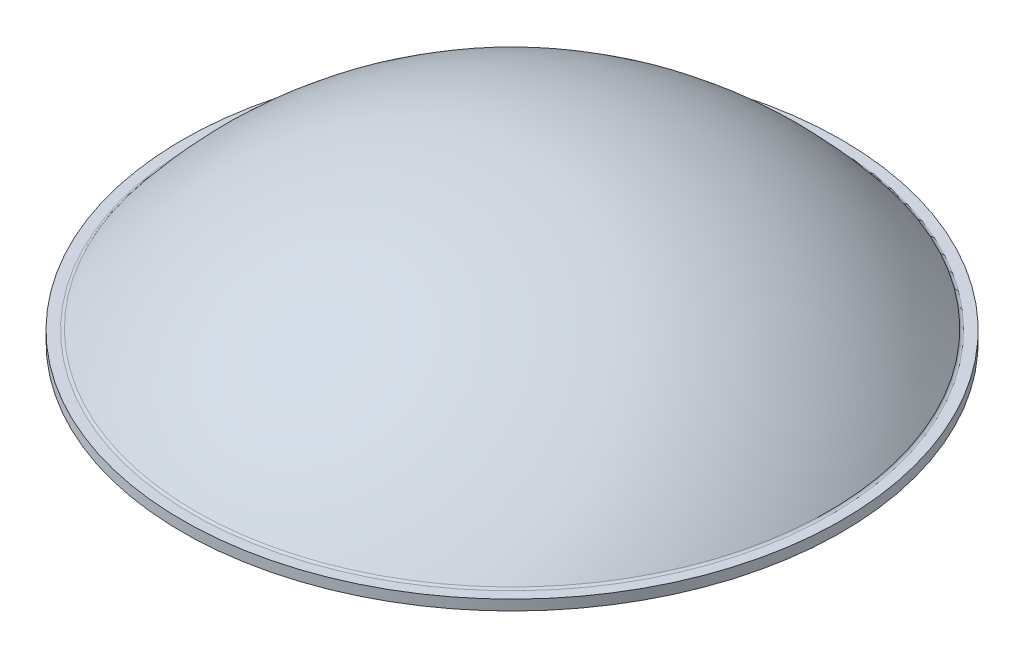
ISO-10303-21;
HEADER;
FILE_DESCRIPTION(('STEP AP214'),'2;1');
FILE_NAME('part.step','',(''),(''),'','','');
FILE_SCHEMA(('AUTOMOTIVE_DESIGN { 1 0 10303 214 1 1 1 1 }'));
ENDSEC;
DATA;
#1=APPLICATION_CONTEXT('core data for automotive mechanical design processes');
#2=APPLICATION_PROTOCOL_DEFINITION('international standard','automotive_design',2000,#1);
#3=PRODUCT_CONTEXT('',#1,'mechanical');
#4=PRODUCT('Part','Part','',(#3));
#5=PRODUCT_RELATED_PRODUCT_CATEGORY('part','',(#4));
#6=PRODUCT_DEFINITION_FORMATION('','',#4);
#7=PRODUCT_DEFINITION_CONTEXT('part definition',#1,'design');
#8=PRODUCT_DEFINITION('design','',#6,#7);
#9=PRODUCT_DEFINITION_SHAPE('','',#8);
#10=(LENGTH_UNIT() NAMED_UNIT(*) SI_UNIT(.MILLI.,.METRE.));
#11=(NAMED_UNIT(*) PLANE_ANGLE_UNIT() SI_UNIT($,.RADIAN.));
#12=(NAMED_UNIT(*) SI_UNIT($,.STERADIAN.) SOLID_ANGLE_UNIT());
#13=UNCERTAINTY_MEASURE_WITH_UNIT(LENGTH_MEASURE(1.E-05),#10,'distance_accuracy_value','');
#14=(GEOMETRIC_REPRESENTATION_CONTEXT(3) GLOBAL_UNCERTAINTY_ASSIGNED_CONTEXT((#13)) GLOBAL_UNIT_ASSIGNED_CONTEXT((#10,
#11,#12)) REPRESENTATION_CONTEXT('',''));
#15=CARTESIAN_POINT('',(0.,0.,0.));
#16=DIRECTION('',(0.,0.,1.));
#17=DIRECTION('',(1.,0.,0.));
#18=AXIS2_PLACEMENT_3D('',#15,#16,#17);
#19=CARTESIAN_POINT('',(0.,0.,0.));
#20=DIRECTION('',(0.,1.,0.));
#21=DIRECTION('',(0.,0.,1.));
#22=AXIS2_PLACEMENT_3D('',#19,#20,#21);
#23=PLANE('',#22);
#24=CARTESIAN_POINT('',(0.,0.,0.));
#25=DIRECTION('',(0.,-1.,0.));
#26=DIRECTION('',(0.,0.,-1.));
#27=AXIS2_PLACEMENT_3D('',#24,#25,#26);
#28=CIRCLE('',#27,3.175);
#29=CARTESIAN_POINT('',(0.,0.,-3.175));
#30=VERTEX_POINT('',#29);
#31=EDGE_CURVE('E10',#30,#30,#28,.T.);
#32=ORIENTED_EDGE('',*,*,#31,.T.);
#33=EDGE_LOOP('',(#32));
#34=FACE_BOUND('',#33,.T.);
#35=ADVANCED_FACE('F32',(#34),#23,.F.);
#36=CARTESIAN_POINT('',(0.,0.,0.));
#37=DIRECTION('',(0.,-1.,0.));
#38=DIRECTION('',(0.,0.,-1.));
#39=AXIS2_PLACEMENT_3D('',#36,#37,#38);
#40=CYLINDRICAL_SURFACE('',#39,3.175);
#41=ORIENTED_EDGE('',*,*,#31,.F.);
#42=EDGE_LOOP('',(#41));
#43=FACE_BOUND('',#42,.T.);
#44=CARTESIAN_POINT('',(0.,0.09921875,0.));
#45=DIRECTION('',(0.,-1.,0.));
#46=DIRECTION('',(0.,0.,-1.));
#47=AXIS2_PLACEMENT_3D('',#44,#45,#46);
#48=CIRCLE('',#47,3.175);
#49=CARTESIAN_POINT('',(0.,0.09921875,-3.175));
#50=VERTEX_POINT('',#49);
#51=EDGE_CURVE('E38',#50,#50,#48,.T.);
#52=ORIENTED_EDGE('',*,*,#51,.T.);
#53=EDGE_LOOP('',(#52));
#54=FACE_BOUND('',#53,.T.);
#55=ADVANCED_FACE('F64',(#43,#54),#40,.T.);
#56=CARTESIAN_POINT('',(0.,0.09921875,3.175));
#57=DIRECTION('',(0.,-1.,0.));
#58=DIRECTION('',(0.,0.,-1.));
#59=AXIS2_PLACEMENT_3D('',#56,#57,#58);
#60=PLANE('',#59);
#61=ORIENTED_EDGE('',*,*,#51,.F.);
#62=EDGE_LOOP('',(#61));
#63=FACE_BOUND('',#62,.T.);
#64=CARTESIAN_POINT('',(0.,0.09921875,0.));
#65=DIRECTION('',(0.,-1.,0.));
#66=DIRECTION('',(0.,0.,-1.));
#67=AXIS2_PLACEMENT_3D('',#64,#65,#66);
#68=CIRCLE('',#67,3.07578125);
#69=CARTESIAN_POINT('',(0.,0.09921875,-3.07578125));
#70=VERTEX_POINT('',#69);
#71=EDGE_CURVE('E42',#70,#70,#68,.T.);
#72=ORIENTED_EDGE('',*,*,#71,.T.);
#73=EDGE_LOOP('',(#72));
#74=FACE_BOUND('',#73,.T.);
#75=ADVANCED_FACE('F60',(#63,#74),#60,.F.);
#76=CARTESIAN_POINT('',(0.,0.132291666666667,0.));
#77=DIRECTION('',(0.,-1.,0.));
#78=DIRECTION('',(0.,0.,-1.));
#79=AXIS2_PLACEMENT_3D('',#76,#77,#78);
#80=TOROIDAL_SURFACE('',#79,3.07578125,0.0330729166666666);
#81=ORIENTED_EDGE('',*,*,#71,.F.);
#82=EDGE_LOOP('',(#81));
#83=FACE_BOUND('',#82,.T.);
#84=CARTESIAN_POINT('',(0.,0.111767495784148,0.));
#85=DIRECTION('',(0.,-1.,0.));
#86=DIRECTION('',(0.,0.,-1.));
#87=AXIS2_PLACEMENT_3D('',#84,#85,#86);
#88=CIRCLE('',#87,3.04984717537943);
#89=CARTESIAN_POINT('',(0.,0.111767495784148,-3.04984717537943));
#90=VERTEX_POINT('',#89);
#91=EDGE_CURVE('E46',#90,#90,#88,.T.);
#92=ORIENTED_EDGE('',*,*,#91,.T.);
#93=EDGE_LOOP('',(#92));
#94=FACE_BOUND('',#93,.T.);
#95=ADVANCED_FACE('F52',(#83,#94),#80,.F.);
#96=CARTESIAN_POINT('',(0.,-2.301875,0.));
#97=DIRECTION('',(0.,-1.,0.));
#98=DIRECTION('',(0.,0.,1.));
#99=AXIS2_PLACEMENT_3D('',#96,#97,#98);
#100=SPHERICAL_SURFACE('',#99,3.889375);
#101=ORIENTED_EDGE('',*,*,#91,.F.);
#102=EDGE_LOOP('',(#101));
#103=FACE_BOUND('',#102,.T.);
#104=ADVANCED_FACE('F54',(#103),#100,.T.);
#105=CLOSED_SHELL('',(#35,#55,#75,#95,#104));
#106=MANIFOLD_SOLID_BREP('B2',#105);
#107=ADVANCED_BREP_SHAPE_REPRESENTATION('',(#18,#106),#14);
#108=SHAPE_DEFINITION_REPRESENTATION(#9,#107);
ENDSEC;
END-ISO-10303-21;
